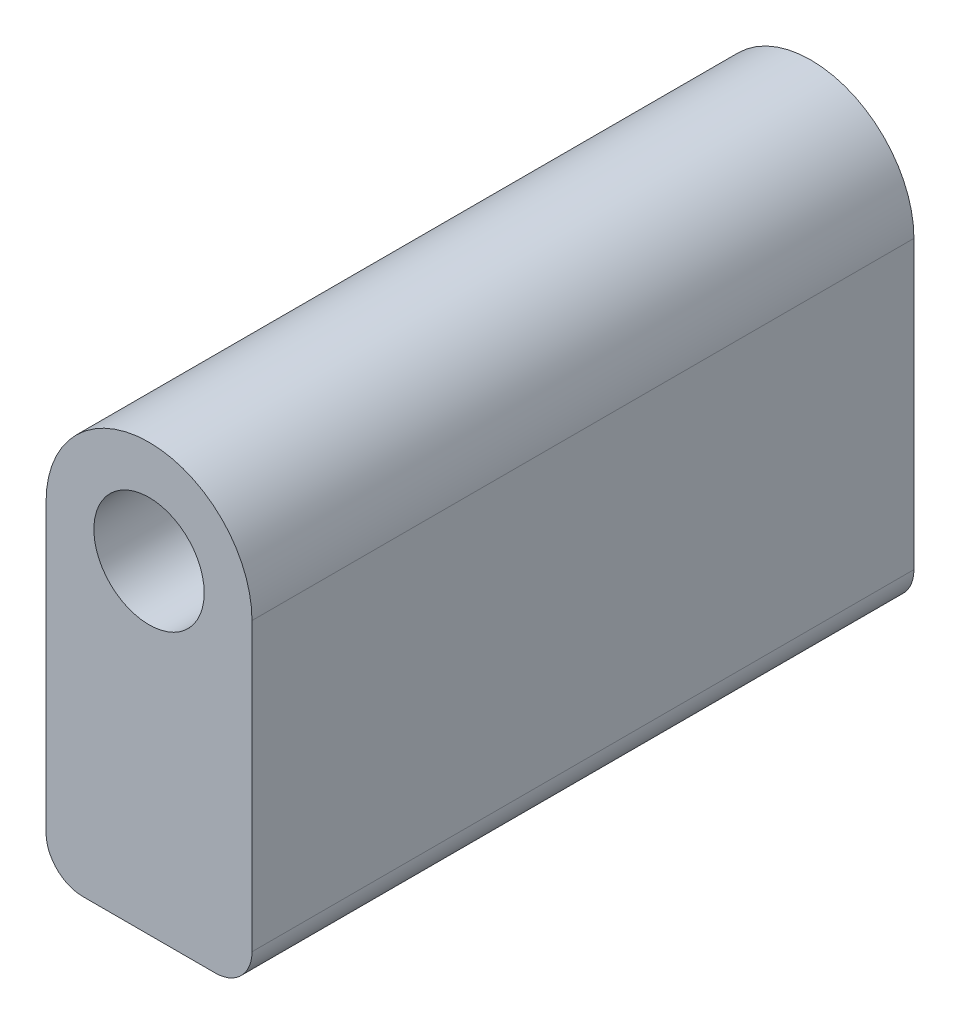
ISO-10303-21;
HEADER;
FILE_DESCRIPTION(('STEP AP214'),'2;1');
FILE_NAME('part.step','',(''),(''),'','','');
FILE_SCHEMA(('AUTOMOTIVE_DESIGN { 1 0 10303 214 1 1 1 1 }'));
ENDSEC;
DATA;
#1=APPLICATION_CONTEXT('core data for automotive mechanical design processes');
#2=APPLICATION_PROTOCOL_DEFINITION('international standard','automotive_design',2000,#1);
#3=PRODUCT_CONTEXT('',#1,'mechanical');
#4=PRODUCT('Part','Part','',(#3));
#5=PRODUCT_RELATED_PRODUCT_CATEGORY('part','',(#4));
#6=PRODUCT_DEFINITION_FORMATION('','',#4);
#7=PRODUCT_DEFINITION_CONTEXT('part definition',#1,'design');
#8=PRODUCT_DEFINITION('design','',#6,#7);
#9=PRODUCT_DEFINITION_SHAPE('','',#8);
#10=(LENGTH_UNIT() NAMED_UNIT(*) SI_UNIT(.MILLI.,.METRE.));
#11=(NAMED_UNIT(*) PLANE_ANGLE_UNIT() SI_UNIT($,.RADIAN.));
#12=(NAMED_UNIT(*) SI_UNIT($,.STERADIAN.) SOLID_ANGLE_UNIT());
#13=UNCERTAINTY_MEASURE_WITH_UNIT(LENGTH_MEASURE(1.E-05),#10,'distance_accuracy_value','');
#14=(GEOMETRIC_REPRESENTATION_CONTEXT(3) GLOBAL_UNCERTAINTY_ASSIGNED_CONTEXT((#13)) GLOBAL_UNIT_ASSIGNED_CONTEXT((#10,
#11,#12)) REPRESENTATION_CONTEXT('',''));
#15=CARTESIAN_POINT('',(0.,0.,0.));
#16=DIRECTION('',(0.,0.,1.));
#17=DIRECTION('',(1.,0.,0.));
#18=AXIS2_PLACEMENT_3D('',#15,#16,#17);
#19=CARTESIAN_POINT('',(0.,-176.53,114.3));
#20=DIRECTION('',(0.,1.,0.));
#21=DIRECTION('',(0.,0.,1.));
#22=AXIS2_PLACEMENT_3D('',#19,#20,#21);
#23=PLANE('',#22);
#24=DIRECTION('',(1.,0.,0.));
#25=VECTOR('',#24,1.);
#26=CARTESIAN_POINT('',(0.,-176.53,0.));
#27=LINE('',#26,#25);
#28=CARTESIAN_POINT('',(-392.43,-176.53,0.));
#29=VERTEX_POINT('',#28);
#30=CARTESIAN_POINT('',(-369.57,-176.53,0.));
#31=VERTEX_POINT('',#30);
#32=EDGE_CURVE('E129',#29,#31,#27,.T.);
#33=ORIENTED_EDGE('',*,*,#32,.T.);
#34=DIRECTION('',(0.,0.,-1.));
#35=VECTOR('',#34,1.);
#36=CARTESIAN_POINT('',(-369.57,-176.53,114.3));
#37=LINE('',#36,#35);
#38=CARTESIAN_POINT('',(-369.57,-176.53,114.3));
#39=VERTEX_POINT('',#38);
#40=EDGE_CURVE('E62',#31,#39,#37,.F.);
#41=ORIENTED_EDGE('',*,*,#40,.T.);
#42=DIRECTION('',(1.,0.,0.));
#43=VECTOR('',#42,1.);
#44=CARTESIAN_POINT('',(0.,-176.53,114.3));
#45=LINE('',#44,#43);
#46=CARTESIAN_POINT('',(-392.43,-176.53,114.3));
#47=VERTEX_POINT('',#46);
#48=EDGE_CURVE('E120',#47,#39,#45,.T.);
#49=ORIENTED_EDGE('',*,*,#48,.F.);
#50=DIRECTION('',(0.,0.,-1.));
#51=VECTOR('',#50,1.);
#52=CARTESIAN_POINT('',(-392.43,-176.53,114.3));
#53=LINE('',#52,#51);
#54=EDGE_CURVE('E144',#47,#29,#53,.T.);
#55=ORIENTED_EDGE('',*,*,#54,.T.);
#56=EDGE_LOOP('',(#33,#41,#49,#55));
#57=FACE_BOUND('',#56,.T.);
#58=ADVANCED_FACE('F41',(#57),#23,.F.);
#59=CARTESIAN_POINT('',(-363.22,1.13401351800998E-12,114.3));
#60=DIRECTION('',(1.,0.,0.));
#61=DIRECTION('',(0.,1.,0.));
#62=AXIS2_PLACEMENT_3D('',#59,#60,#61);
#63=PLANE('',#62);
#64=DIRECTION('',(0.,-1.,0.));
#65=VECTOR('',#64,1.);
#66=CARTESIAN_POINT('',(-363.22,1.13401351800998E-12,114.3));
#67=LINE('',#66,#65);
#68=CARTESIAN_POINT('',(-363.22,-120.65,114.3));
#69=VERTEX_POINT('',#68);
#70=CARTESIAN_POINT('',(-363.22,-170.18,114.3));
#71=VERTEX_POINT('',#70);
#72=EDGE_CURVE('E101',#69,#71,#67,.T.);
#73=ORIENTED_EDGE('',*,*,#72,.T.);
#74=DIRECTION('',(0.,0.,-1.));
#75=VECTOR('',#74,1.);
#76=CARTESIAN_POINT('',(-363.22,-170.18,0.));
#77=LINE('',#76,#75);
#78=CARTESIAN_POINT('',(-363.22,-170.18,0.));
#79=VERTEX_POINT('',#78);
#80=EDGE_CURVE('E107',#71,#79,#77,.T.);
#81=ORIENTED_EDGE('',*,*,#80,.T.);
#82=DIRECTION('',(0.,-1.,0.));
#83=VECTOR('',#82,1.);
#84=CARTESIAN_POINT('',(-363.22,1.13401351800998E-12,0.));
#85=LINE('',#84,#83);
#86=CARTESIAN_POINT('',(-363.22,-120.65,0.));
#87=VERTEX_POINT('',#86);
#88=EDGE_CURVE('E104',#87,#79,#85,.T.);
#89=ORIENTED_EDGE('',*,*,#88,.F.);
#90=DIRECTION('',(0.,0.,-1.));
#91=VECTOR('',#90,1.);
#92=CARTESIAN_POINT('',(-363.22,-120.65,114.3));
#93=LINE('',#92,#91);
#94=EDGE_CURVE('E96',#69,#87,#93,.T.);
#95=ORIENTED_EDGE('',*,*,#94,.F.);
#96=EDGE_LOOP('',(#73,#81,#89,#95));
#97=FACE_BOUND('',#96,.T.);
#98=ADVANCED_FACE('F98',(#97),#63,.T.);
#99=CARTESIAN_POINT('',(-381.,-120.65,114.3));
#100=DIRECTION('',(0.,0.,-1.));
#101=DIRECTION('',(-1.,0.,0.));
#102=AXIS2_PLACEMENT_3D('',#99,#100,#101);
#103=CYLINDRICAL_SURFACE('',#102,17.78);
#104=CARTESIAN_POINT('',(-381.,-120.65,0.));
#105=DIRECTION('',(0.,0.,1.));
#106=DIRECTION('',(1.,0.,0.));
#107=AXIS2_PLACEMENT_3D('',#104,#105,#106);
#108=CIRCLE('',#107,17.78);
#109=CARTESIAN_POINT('',(-398.78,-120.65,0.));
#110=VERTEX_POINT('',#109);
#111=EDGE_CURVE('E132',#87,#110,#108,.T.);
#112=ORIENTED_EDGE('',*,*,#111,.T.);
#113=DIRECTION('',(0.,0.,-1.));
#114=VECTOR('',#113,1.);
#115=CARTESIAN_POINT('',(-398.78,-120.65,114.3));
#116=LINE('',#115,#114);
#117=CARTESIAN_POINT('',(-398.78,-120.65,114.3));
#118=VERTEX_POINT('',#117);
#119=EDGE_CURVE('E108',#118,#110,#116,.T.);
#120=ORIENTED_EDGE('',*,*,#119,.F.);
#121=CARTESIAN_POINT('',(-381.,-120.65,114.3));
#122=DIRECTION('',(0.,0.,1.));
#123=DIRECTION('',(1.,0.,0.));
#124=AXIS2_PLACEMENT_3D('',#121,#122,#123);
#125=CIRCLE('',#124,17.78);
#126=EDGE_CURVE('E111',#69,#118,#125,.T.);
#127=ORIENTED_EDGE('',*,*,#126,.F.);
#128=ORIENTED_EDGE('',*,*,#94,.T.);
#129=EDGE_LOOP('',(#112,#120,#127,#128));
#130=FACE_BOUND('',#129,.T.);
#131=ADVANCED_FACE('F112',(#130),#103,.T.);
#132=CARTESIAN_POINT('',(-398.780000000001,-1.2450358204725E-12,114.3));
#133=DIRECTION('',(1.,0.,0.));
#134=DIRECTION('',(0.,1.,0.));
#135=AXIS2_PLACEMENT_3D('',#132,#133,#134);
#136=PLANE('',#135);
#137=DIRECTION('',(0.,-1.,0.));
#138=VECTOR('',#137,1.);
#139=CARTESIAN_POINT('',(-398.780000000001,-1.2450358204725E-12,0.));
#140=LINE('',#139,#138);
#141=CARTESIAN_POINT('',(-398.78,-170.18,0.));
#142=VERTEX_POINT('',#141);
#143=EDGE_CURVE('E134',#110,#142,#140,.T.);
#144=ORIENTED_EDGE('',*,*,#143,.T.);
#145=DIRECTION('',(0.,0.,-1.));
#146=VECTOR('',#145,1.);
#147=CARTESIAN_POINT('',(-398.78,-170.18,114.3));
#148=LINE('',#147,#146);
#149=CARTESIAN_POINT('',(-398.78,-170.18,114.3));
#150=VERTEX_POINT('',#149);
#151=EDGE_CURVE('E11',#142,#150,#148,.F.);
#152=ORIENTED_EDGE('',*,*,#151,.T.);
#153=DIRECTION('',(0.,-1.,0.));
#154=VECTOR('',#153,1.);
#155=CARTESIAN_POINT('',(-398.780000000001,-1.2450358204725E-12,114.3));
#156=LINE('',#155,#154);
#157=EDGE_CURVE('E115',#118,#150,#156,.T.);
#158=ORIENTED_EDGE('',*,*,#157,.F.);
#159=ORIENTED_EDGE('',*,*,#119,.T.);
#160=EDGE_LOOP('',(#144,#152,#158,#159));
#161=FACE_BOUND('',#160,.T.);
#162=ADVANCED_FACE('F157',(#161),#136,.F.);
#163=CARTESIAN_POINT('',(-381.,-120.65,114.3));
#164=DIRECTION('',(0.,0.,-1.));
#165=DIRECTION('',(-1.,0.,0.));
#166=AXIS2_PLACEMENT_3D('',#163,#164,#165);
#167=CYLINDRICAL_SURFACE('',#166,9.52499999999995);
#168=CARTESIAN_POINT('',(-381.,-120.65,114.3));
#169=DIRECTION('',(0.,0.,1.));
#170=DIRECTION('',(1.,0.,0.));
#171=AXIS2_PLACEMENT_3D('',#168,#169,#170);
#172=CIRCLE('',#171,9.52499999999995);
#173=CARTESIAN_POINT('',(-371.475,-120.65,114.3));
#174=VERTEX_POINT('',#173);
#175=EDGE_CURVE('E126',#174,#174,#172,.T.);
#176=ORIENTED_EDGE('',*,*,#175,.T.);
#177=EDGE_LOOP('',(#176));
#178=FACE_BOUND('',#177,.T.);
#179=CARTESIAN_POINT('',(-381.,-120.65,0.));
#180=DIRECTION('',(0.,0.,1.));
#181=DIRECTION('',(1.,0.,0.));
#182=AXIS2_PLACEMENT_3D('',#179,#180,#181);
#183=CIRCLE('',#182,9.52499999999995);
#184=CARTESIAN_POINT('',(-371.475,-120.65,0.));
#185=VERTEX_POINT('',#184);
#186=EDGE_CURVE('E122',#185,#185,#183,.T.);
#187=ORIENTED_EDGE('',*,*,#186,.F.);
#188=EDGE_LOOP('',(#187));
#189=FACE_BOUND('',#188,.T.);
#190=ADVANCED_FACE('F159',(#178,#189),#167,.F.);
#191=CARTESIAN_POINT('',(0.,0.,114.3));
#192=DIRECTION('',(0.,0.,1.));
#193=DIRECTION('',(1.,0.,0.));
#194=AXIS2_PLACEMENT_3D('',#191,#192,#193);
#195=PLANE('',#194);
#196=ORIENTED_EDGE('',*,*,#48,.T.);
#197=CARTESIAN_POINT('',(-369.57,-170.18,114.3));
#198=DIRECTION('',(0.,0.,1.));
#199=DIRECTION('',(1.,0.,0.));
#200=AXIS2_PLACEMENT_3D('',#197,#198,#199);
#201=CIRCLE('',#200,6.35);
#202=EDGE_CURVE('E49',#39,#71,#201,.T.);
#203=ORIENTED_EDGE('',*,*,#202,.T.);
#204=ORIENTED_EDGE('',*,*,#72,.F.);
#205=ORIENTED_EDGE('',*,*,#126,.T.);
#206=ORIENTED_EDGE('',*,*,#157,.T.);
#207=CARTESIAN_POINT('',(-392.43,-170.18,114.3));
#208=DIRECTION('',(0.,0.,1.));
#209=DIRECTION('',(1.,0.,0.));
#210=AXIS2_PLACEMENT_3D('',#207,#208,#209);
#211=CIRCLE('',#210,6.35);
#212=EDGE_CURVE('E148',#150,#47,#211,.T.);
#213=ORIENTED_EDGE('',*,*,#212,.T.);
#214=EDGE_LOOP('',(#196,#203,#204,#205,#206,#213));
#215=FACE_BOUND('',#214,.T.);
#216=ORIENTED_EDGE('',*,*,#175,.F.);
#217=EDGE_LOOP('',(#216));
#218=FACE_BOUND('',#217,.T.);
#219=ADVANCED_FACE('F117',(#215,#218),#195,.T.);
#220=CARTESIAN_POINT('',(0.,0.,0.));
#221=DIRECTION('',(0.,0.,1.));
#222=DIRECTION('',(1.,0.,0.));
#223=AXIS2_PLACEMENT_3D('',#220,#221,#222);
#224=PLANE('',#223);
#225=ORIENTED_EDGE('',*,*,#88,.T.);
#226=CARTESIAN_POINT('',(-369.57,-170.18,0.));
#227=DIRECTION('',(0.,0.,1.));
#228=DIRECTION('',(1.,0.,0.));
#229=AXIS2_PLACEMENT_3D('',#226,#227,#228);
#230=CIRCLE('',#229,6.35);
#231=EDGE_CURVE('E142',#79,#31,#230,.F.);
#232=ORIENTED_EDGE('',*,*,#231,.T.);
#233=ORIENTED_EDGE('',*,*,#32,.F.);
#234=CARTESIAN_POINT('',(-392.43,-170.18,0.));
#235=DIRECTION('',(0.,0.,1.));
#236=DIRECTION('',(1.,0.,0.));
#237=AXIS2_PLACEMENT_3D('',#234,#235,#236);
#238=CIRCLE('',#237,6.35);
#239=EDGE_CURVE('E140',#29,#142,#238,.F.);
#240=ORIENTED_EDGE('',*,*,#239,.T.);
#241=ORIENTED_EDGE('',*,*,#143,.F.);
#242=ORIENTED_EDGE('',*,*,#111,.F.);
#243=EDGE_LOOP('',(#225,#232,#233,#240,#241,#242));
#244=FACE_BOUND('',#243,.T.);
#245=ORIENTED_EDGE('',*,*,#186,.T.);
#246=EDGE_LOOP('',(#245));
#247=FACE_BOUND('',#246,.T.);
#248=ADVANCED_FACE('F155',(#244,#247),#224,.F.);
#249=CARTESIAN_POINT('',(-369.57,-170.18,114.3));
#250=DIRECTION('',(0.,0.,1.));
#251=DIRECTION('',(1.,0.,0.));
#252=AXIS2_PLACEMENT_3D('',#249,#250,#251);
#253=CYLINDRICAL_SURFACE('',#252,6.35);
#254=ORIENTED_EDGE('',*,*,#202,.F.);
#255=ORIENTED_EDGE('',*,*,#40,.F.);
#256=ORIENTED_EDGE('',*,*,#231,.F.);
#257=ORIENTED_EDGE('',*,*,#80,.F.);
#258=EDGE_LOOP('',(#254,#255,#256,#257));
#259=FACE_BOUND('',#258,.T.);
#260=ADVANCED_FACE('F175',(#259),#253,.T.);
#261=CARTESIAN_POINT('',(-392.43,-170.18,114.3));
#262=DIRECTION('',(0.,0.,-1.));
#263=DIRECTION('',(-1.,0.,0.));
#264=AXIS2_PLACEMENT_3D('',#261,#262,#263);
#265=CYLINDRICAL_SURFACE('',#264,6.35);
#266=ORIENTED_EDGE('',*,*,#212,.F.);
#267=ORIENTED_EDGE('',*,*,#151,.F.);
#268=ORIENTED_EDGE('',*,*,#239,.F.);
#269=ORIENTED_EDGE('',*,*,#54,.F.);
#270=EDGE_LOOP('',(#266,#267,#268,#269));
#271=FACE_BOUND('',#270,.T.);
#272=ADVANCED_FACE('F43',(#271),#265,.T.);
#273=CLOSED_SHELL('',(#58,#98,#131,#162,#190,#219,#248,#260,#272));
#274=MANIFOLD_SOLID_BREP('B2',#273);
#275=ADVANCED_BREP_SHAPE_REPRESENTATION('',(#18,#274),#14);
#276=SHAPE_DEFINITION_REPRESENTATION(#9,#275);
ENDSEC;
END-ISO-10303-21;
